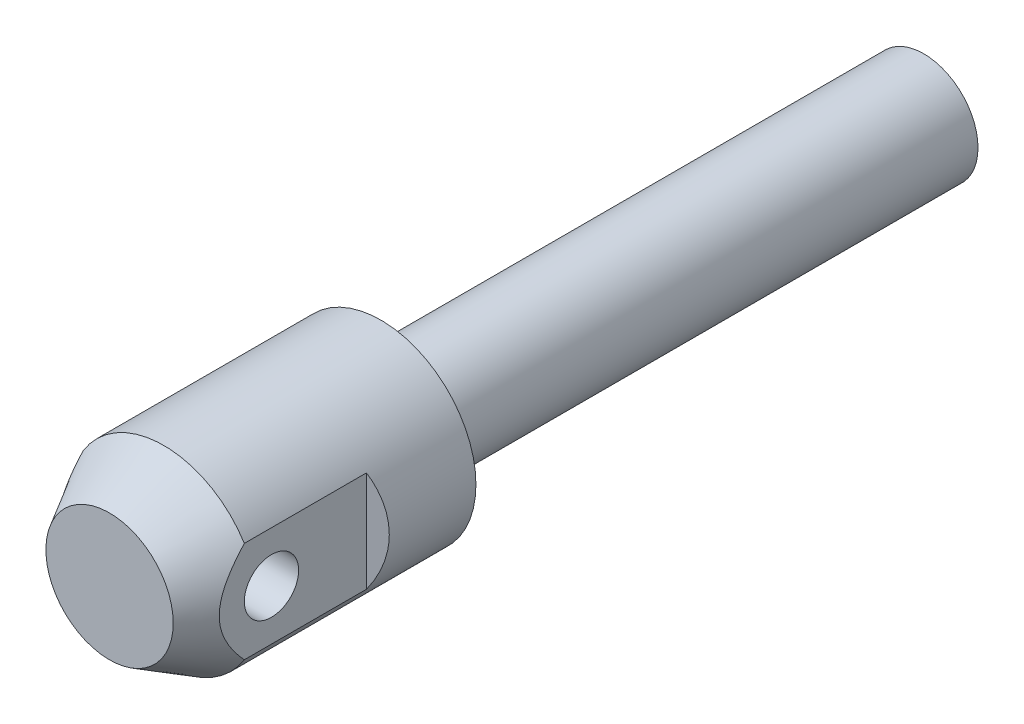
ISO-10303-21;
HEADER;
FILE_DESCRIPTION(('STEP AP214'),'2;1');
FILE_NAME('part.step','',(''),(''),'','','');
FILE_SCHEMA(('AUTOMOTIVE_DESIGN { 1 0 10303 214 1 1 1 1 }'));
ENDSEC;
DATA;
#1=APPLICATION_CONTEXT('core data for automotive mechanical design processes');
#2=APPLICATION_PROTOCOL_DEFINITION('international standard','automotive_design',2000,#1);
#3=PRODUCT_CONTEXT('',#1,'mechanical');
#4=PRODUCT('Part','Part','',(#3));
#5=PRODUCT_RELATED_PRODUCT_CATEGORY('part','',(#4));
#6=PRODUCT_DEFINITION_FORMATION('','',#4);
#7=PRODUCT_DEFINITION_CONTEXT('part definition',#1,'design');
#8=PRODUCT_DEFINITION('design','',#6,#7);
#9=PRODUCT_DEFINITION_SHAPE('','',#8);
#10=(LENGTH_UNIT() NAMED_UNIT(*) SI_UNIT(.MILLI.,.METRE.));
#11=(NAMED_UNIT(*) PLANE_ANGLE_UNIT() SI_UNIT($,.RADIAN.));
#12=(NAMED_UNIT(*) SI_UNIT($,.STERADIAN.) SOLID_ANGLE_UNIT());
#13=UNCERTAINTY_MEASURE_WITH_UNIT(LENGTH_MEASURE(1.E-05),#10,'distance_accuracy_value','');
#14=(GEOMETRIC_REPRESENTATION_CONTEXT(3) GLOBAL_UNCERTAINTY_ASSIGNED_CONTEXT((#13)) GLOBAL_UNIT_ASSIGNED_CONTEXT((#10,
#11,#12)) REPRESENTATION_CONTEXT('',''));
#15=CARTESIAN_POINT('',(0.,0.,0.));
#16=DIRECTION('',(0.,0.,1.));
#17=DIRECTION('',(1.,0.,0.));
#18=AXIS2_PLACEMENT_3D('',#15,#16,#17);
#19=CARTESIAN_POINT('',(0.,0.,20.));
#20=DIRECTION('',(0.,0.,1.));
#21=DIRECTION('',(1.,0.,0.));
#22=AXIS2_PLACEMENT_3D('',#19,#20,#21);
#23=CYLINDRICAL_SURFACE('',#22,10.5);
#24=CARTESIAN_POINT('',(0.,0.,0.));
#25=DIRECTION('',(0.,0.,1.));
#26=DIRECTION('',(1.,0.,0.));
#27=AXIS2_PLACEMENT_3D('',#24,#25,#26);
#28=CIRCLE('',#27,10.5);
#29=CARTESIAN_POINT('',(10.5,0.,0.));
#30=VERTEX_POINT('',#29);
#31=EDGE_CURVE('E82',#30,#30,#28,.T.);
#32=ORIENTED_EDGE('',*,*,#31,.T.);
#33=EDGE_LOOP('',(#32));
#34=FACE_BOUND('',#33,.T.);
#35=CARTESIAN_POINT('',(0.,0.,24.));
#36=DIRECTION('',(0.,0.,1.));
#37=DIRECTION('',(1.,0.,0.));
#38=AXIS2_PLACEMENT_3D('',#35,#36,#37);
#39=CIRCLE('',#38,10.5);
#40=CARTESIAN_POINT('',(-8.9,-5.57135531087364,24.));
#41=VERTEX_POINT('',#40);
#42=CARTESIAN_POINT('',(8.9,-5.57135531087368,24.));
#43=VERTEX_POINT('',#42);
#44=EDGE_CURVE('E67',#41,#43,#39,.T.);
#45=ORIENTED_EDGE('',*,*,#44,.F.);
#46=DIRECTION('',(0.,0.,1.));
#47=VECTOR('',#46,1.);
#48=CARTESIAN_POINT('',(-8.9,-5.57135531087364,20.));
#49=LINE('',#48,#47);
#50=CARTESIAN_POINT('',(-8.9,-5.57135531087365,10.5));
#51=VERTEX_POINT('',#50);
#52=EDGE_CURVE('E30',#41,#51,#49,.F.);
#53=ORIENTED_EDGE('',*,*,#52,.T.);
#54=CARTESIAN_POINT('',(0.,0.,15.6384173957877));
#55=DIRECTION('',(0.5,0.,-0.866025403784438));
#56=DIRECTION('',(0.866025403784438,0.,0.5));
#57=AXIS2_PLACEMENT_3D('',#54,#55,#56);
#58=ELLIPSE('',#57,12.1243556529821,10.5);
#59=CARTESIAN_POINT('',(-8.9,5.57135531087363,10.5));
#60=VERTEX_POINT('',#59);
#61=EDGE_CURVE('E9',#60,#51,#58,.F.);
#62=ORIENTED_EDGE('',*,*,#61,.F.);
#63=DIRECTION('',(0.,0.,1.));
#64=VECTOR('',#63,1.);
#65=CARTESIAN_POINT('',(-8.9,5.57135531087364,20.));
#66=LINE('',#65,#64);
#67=CARTESIAN_POINT('',(-8.9,5.57135531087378,24.));
#68=VERTEX_POINT('',#67);
#69=EDGE_CURVE('E63',#60,#68,#66,.T.);
#70=ORIENTED_EDGE('',*,*,#69,.T.);
#71=CARTESIAN_POINT('',(8.9,5.57135531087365,24.));
#72=VERTEX_POINT('',#71);
#73=EDGE_CURVE('E79',#72,#68,#39,.T.);
#74=ORIENTED_EDGE('',*,*,#73,.F.);
#75=DIRECTION('',(0.,0.,1.));
#76=VECTOR('',#75,1.);
#77=CARTESIAN_POINT('',(8.9,5.57135531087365,20.));
#78=LINE('',#77,#76);
#79=CARTESIAN_POINT('',(8.9,5.57135531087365,10.5));
#80=VERTEX_POINT('',#79);
#81=EDGE_CURVE('E38',#80,#72,#78,.T.);
#82=ORIENTED_EDGE('',*,*,#81,.F.);
#83=CARTESIAN_POINT('',(0.,0.,15.6384173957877));
#84=DIRECTION('',(0.5,0.,0.866025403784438));
#85=DIRECTION('',(-0.866025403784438,0.,0.5));
#86=AXIS2_PLACEMENT_3D('',#83,#84,#85);
#87=ELLIPSE('',#86,12.1243556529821,10.5);
#88=CARTESIAN_POINT('',(8.9,-5.57135531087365,10.5));
#89=VERTEX_POINT('',#88);
#90=EDGE_CURVE('E99',#80,#89,#87,.F.);
#91=ORIENTED_EDGE('',*,*,#90,.T.);
#92=DIRECTION('',(0.,0.,1.));
#93=VECTOR('',#92,1.);
#94=CARTESIAN_POINT('',(8.9,-5.57135531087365,20.));
#95=LINE('',#94,#93);
#96=EDGE_CURVE('E74',#43,#89,#95,.F.);
#97=ORIENTED_EDGE('',*,*,#96,.F.);
#98=EDGE_LOOP('',(#45,#53,#62,#70,#74,#82,#91,#97));
#99=FACE_BOUND('',#98,.T.);
#100=ADVANCED_FACE('F14',(#34,#99),#23,.T.);
#101=CARTESIAN_POINT('',(0.,0.,30.));
#102=DIRECTION('',(0.,0.,-1.));
#103=DIRECTION('',(-1.,0.,0.));
#104=AXIS2_PLACEMENT_3D('',#101,#102,#103);
#105=CONICAL_SURFACE('',#104,7.03589838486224,0.523598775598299);
#106=CARTESIAN_POINT('',(0.,0.,30.));
#107=DIRECTION('',(0.,0.,1.));
#108=DIRECTION('',(1.,0.,0.));
#109=AXIS2_PLACEMENT_3D('',#106,#107,#108);
#110=CIRCLE('',#109,7.03589838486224);
#111=CARTESIAN_POINT('',(7.03589838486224,0.,30.));
#112=VERTEX_POINT('',#111);
#113=EDGE_CURVE('E76',#112,#112,#110,.T.);
#114=ORIENTED_EDGE('',*,*,#113,.F.);
#115=EDGE_LOOP('',(#114));
#116=FACE_BOUND('',#115,.T.);
#117=ORIENTED_EDGE('',*,*,#73,.T.);
#118=CARTESIAN_POINT('',(-8.9,-14.6906497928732,12.4363137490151));
#119=CARTESIAN_POINT('',(-8.9,-14.3724086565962,12.9076685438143));
#120=CARTESIAN_POINT('',(-8.9,-14.0523322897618,13.3777974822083));
#121=CARTESIAN_POINT('',(-8.9,-13.407548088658,14.3149810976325));
#122=CARTESIAN_POINT('',(-8.9,-13.0828394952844,14.7820352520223));
#123=CARTESIAN_POINT('',(-8.9,-12.4255724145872,15.7156455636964));
#124=CARTESIAN_POINT('',(-8.9,-12.0929741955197,16.1821738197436));
#125=CARTESIAN_POINT('',(-8.9,-11.4209532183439,17.1102280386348));
#126=CARTESIAN_POINT('',(-8.9,-11.0815311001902,17.571754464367));
#127=CARTESIAN_POINT('',(-8.9,-10.3609340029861,18.5327258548));
#128=CARTESIAN_POINT('',(-8.9,-9.97889352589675,19.0315259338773));
#129=CARTESIAN_POINT('',(-8.9,-9.39571279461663,19.7718918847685));
#130=CARTESIAN_POINT('',(-8.9,-9.19959708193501,20.0174174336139));
#131=CARTESIAN_POINT('',(-8.9,-8.80347960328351,20.5053096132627));
#132=CARTESIAN_POINT('',(-8.9,-8.60347794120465,20.747676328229));
#133=CARTESIAN_POINT('',(-8.9,-8.19961550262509,21.2278453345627));
#134=CARTESIAN_POINT('',(-8.9,-7.99576927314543,21.4656598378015));
#135=CARTESIAN_POINT('',(-8.9,-7.58284404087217,21.9366910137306));
#136=CARTESIAN_POINT('',(-8.9,-7.37376534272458,22.1699079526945));
#137=CARTESIAN_POINT('',(-8.9,-6.94954847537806,22.6305427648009));
#138=CARTESIAN_POINT('',(-8.9,-6.7344136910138,22.8579637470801));
#139=CARTESIAN_POINT('',(-8.9,-6.29685389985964,23.3056566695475));
#140=CARTESIAN_POINT('',(-8.9,-6.0744301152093,23.5259297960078));
#141=CARTESIAN_POINT('',(-8.9,-5.72815075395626,23.8552673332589));
#142=CARTESIAN_POINT('',(-8.9,-5.60744255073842,23.967645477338));
#143=CARTESIAN_POINT('',(-8.9,-5.36335255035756,24.1894714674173));
#144=CARTESIAN_POINT('',(-8.9,-5.23997070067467,24.2989192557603));
#145=CARTESIAN_POINT('',(-8.9,-4.99019185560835,24.5144981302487));
#146=CARTESIAN_POINT('',(-8.9,-4.86379293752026,24.6206269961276));
#147=CARTESIAN_POINT('',(-8.9,-4.60777909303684,24.8289230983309));
#148=CARTESIAN_POINT('',(-8.9,-4.478164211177,24.9310903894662));
#149=CARTESIAN_POINT('',(-8.9,-4.08693511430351,25.2284953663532));
#150=CARTESIAN_POINT('',(-8.9,-3.82016647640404,25.41706407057));
#151=CARTESIAN_POINT('',(-8.9,-3.27068989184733,25.7692475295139));
#152=CARTESIAN_POINT('',(-8.9,-2.98800127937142,25.9328916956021));
#153=CARTESIAN_POINT('',(-8.9,-2.55061558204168,26.1525542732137));
#154=CARTESIAN_POINT('',(-8.9,-2.40241326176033,26.2215402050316));
#155=CARTESIAN_POINT('',(-8.9,-2.10165294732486,26.34932813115));
#156=CARTESIAN_POINT('',(-8.9,-1.94909533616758,26.4081310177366));
#157=CARTESIAN_POINT('',(-8.9,-1.64010234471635,26.5139102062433));
#158=CARTESIAN_POINT('',(-8.9,-1.48367177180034,26.5609004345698));
#159=CARTESIAN_POINT('',(-8.9,-1.16742727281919,26.6415877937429));
#160=CARTESIAN_POINT('',(-8.9,-1.00761423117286,26.6752883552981));
#161=CARTESIAN_POINT('',(-8.9,-0.683771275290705,26.7284010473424));
#162=CARTESIAN_POINT('',(-8.9,-0.519714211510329,26.747649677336));
#163=CARTESIAN_POINT('',(-8.9,-0.190509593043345,26.7703811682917));
#164=CARTESIAN_POINT('',(-8.9,-0.0253621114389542,26.7738650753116));
#165=CARTESIAN_POINT('',(-8.9,0.304423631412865,26.7649088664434));
#166=CARTESIAN_POINT('',(-8.9,0.46906208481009,26.7524757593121));
#167=CARTESIAN_POINT('',(-8.9,0.796447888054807,26.7122663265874));
#168=CARTESIAN_POINT('',(-8.9,0.959194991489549,26.684488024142));
#169=CARTESIAN_POINT('',(-8.9,1.30407432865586,26.6098776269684));
#170=CARTESIAN_POINT('',(-8.9,1.48574670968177,26.5609294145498));
#171=CARTESIAN_POINT('',(-8.9,1.84395793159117,26.4468573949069));
#172=CARTESIAN_POINT('',(-8.9,2.02049430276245,26.3817259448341));
#173=CARTESIAN_POINT('',(-8.9,2.36948052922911,26.2370400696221));
#174=CARTESIAN_POINT('',(-8.9,2.54187510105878,26.1573535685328));
#175=CARTESIAN_POINT('',(-8.9,2.88068743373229,25.9863393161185));
#176=CARTESIAN_POINT('',(-8.9,3.0471064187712,25.8950139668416));
#177=CARTESIAN_POINT('',(-8.9,3.41294088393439,25.6799946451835));
#178=CARTESIAN_POINT('',(-8.9,3.61085279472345,25.5537533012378));
#179=CARTESIAN_POINT('',(-8.9,3.99879031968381,25.2896252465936));
#180=CARTESIAN_POINT('',(-8.9,4.18881244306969,25.1517334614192));
#181=CARTESIAN_POINT('',(-8.9,4.56236330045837,24.8662868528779));
#182=CARTESIAN_POINT('',(-8.9,4.7458696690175,24.7187029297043));
#183=CARTESIAN_POINT('',(-8.9,5.10659178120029,24.4161320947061));
#184=CARTESIAN_POINT('',(-8.9,5.28380851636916,24.2611463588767));
#185=CARTESIAN_POINT('',(-8.9,5.62449488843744,23.9526465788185));
#186=CARTESIAN_POINT('',(-8.9,5.78821792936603,23.7994111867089));
#187=CARTESIAN_POINT('',(-8.9,6.11130761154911,23.4884009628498));
#188=CARTESIAN_POINT('',(-8.9,6.27067390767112,23.3306257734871));
#189=CARTESIAN_POINT('',(-8.9,6.58433981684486,23.0125301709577));
#190=CARTESIAN_POINT('',(-8.9,6.73866911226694,22.8522389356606));
#191=CARTESIAN_POINT('',(-8.9,7.04392315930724,22.5285268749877));
#192=CARTESIAN_POINT('',(-8.9,7.19484883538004,22.3651069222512));
#193=CARTESIAN_POINT('',(-8.9,7.34430663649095,22.200375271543));
#194=B_SPLINE_CURVE_WITH_KNOTS('',3,(#118,#119,#120,#121,#122,#123,#124,#125,#126,#127,#128,
#129,#130,#131,#132,#133,#134,#135,#136,#137,#138,#139,#140,#141,#142,#143,#144,#145,#146,#147,
#148,#149,#150,#151,#152,#153,#154,#155,#156,#157,#158,#159,#160,#161,#162,#163,#164,#165,#166,
#167,#168,#169,#170,#171,#172,#173,#174,#175,#176,#177,#178,#179,#180,#181,#182,#183,#184,#185,
#186,#187,#188,#189,#190,#191,#192,#193),.UNSPECIFIED.,.F.,.F.,(4,2,2,2,2,2,2,2,2,2,2,2,2,2,2,2,
2,2,2,2,2,2,2,2,2,2,2,2,2,2,2,2,2,2,2,2,2,4),(0.,1.70619901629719,3.41268092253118,
5.13147394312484,6.85010651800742,8.73479437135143,9.67747072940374,10.6201219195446,
11.5597291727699,12.4992818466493,13.4383194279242,14.3772003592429,14.8719277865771,
15.3666649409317,15.8617262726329,16.3567807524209,17.335861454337,18.3137777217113,
18.8038864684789,19.2939522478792,19.7834375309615,20.2727963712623,20.7676113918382,
21.2623935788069,21.7569579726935,22.2515860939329,22.8151573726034,23.3789953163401,
23.94822975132,24.5173468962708,25.2210484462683,25.9250580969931,26.6312877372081,
27.3374055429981,28.0100429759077,28.6827335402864,29.3502139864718,30.0175109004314),.UNSPECIFIED.);
#195=EDGE_CURVE('E23',#68,#41,#194,.F.);
#196=ORIENTED_EDGE('',*,*,#195,.T.);
#197=ORIENTED_EDGE('',*,*,#44,.T.);
#198=CARTESIAN_POINT('',(8.9,-14.6906497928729,12.4363137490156));
#199=CARTESIAN_POINT('',(8.9,-14.3724086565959,12.9076685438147));
#200=CARTESIAN_POINT('',(8.9,-14.0523322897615,13.3777974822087));
#201=CARTESIAN_POINT('',(8.9,-13.4075480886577,14.3149810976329));
#202=CARTESIAN_POINT('',(8.9,-13.0828394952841,14.7820352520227));
#203=CARTESIAN_POINT('',(8.9,-12.4255724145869,15.7156455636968));
#204=CARTESIAN_POINT('',(8.9,-12.0929741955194,16.182173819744));
#205=CARTESIAN_POINT('',(8.9,-11.4209532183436,17.1102280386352));
#206=CARTESIAN_POINT('',(8.9,-11.0815311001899,17.5717544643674));
#207=CARTESIAN_POINT('',(8.9,-10.3609340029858,18.5327258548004));
#208=CARTESIAN_POINT('',(8.9,-9.97889352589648,19.0315259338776));
#209=CARTESIAN_POINT('',(8.9,-9.39571279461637,19.7718918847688));
#210=CARTESIAN_POINT('',(8.9,-9.19959708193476,20.0174174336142));
#211=CARTESIAN_POINT('',(8.9,-8.80347960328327,20.505309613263));
#212=CARTESIAN_POINT('',(8.9,-8.60347794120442,20.7476763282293));
#213=CARTESIAN_POINT('',(8.9,-8.19961550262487,21.227845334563));
#214=CARTESIAN_POINT('',(8.9,-7.99576927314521,21.4656598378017));
#215=CARTESIAN_POINT('',(8.9,-7.58284404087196,21.9366910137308));
#216=CARTESIAN_POINT('',(8.9,-7.37376534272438,22.1699079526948));
#217=CARTESIAN_POINT('',(8.9,-6.94954847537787,22.6305427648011));
#218=CARTESIAN_POINT('',(8.9,-6.73441369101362,22.8579637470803));
#219=CARTESIAN_POINT('',(8.9,-6.29685389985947,23.3056566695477));
#220=CARTESIAN_POINT('',(8.9,-6.07443011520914,23.525929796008));
#221=CARTESIAN_POINT('',(8.9,-5.72815075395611,23.855267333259));
#222=CARTESIAN_POINT('',(8.9,-5.60744255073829,23.9676454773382));
#223=CARTESIAN_POINT('',(8.9,-5.36335255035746,24.1894714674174));
#224=CARTESIAN_POINT('',(8.9,-5.23997070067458,24.2989192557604));
#225=CARTESIAN_POINT('',(8.9,-4.99019185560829,24.5144981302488));
#226=CARTESIAN_POINT('',(8.9,-4.86379293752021,24.6206269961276));
#227=CARTESIAN_POINT('',(8.9,-4.60777909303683,24.8289230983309));
#228=CARTESIAN_POINT('',(8.9,-4.478164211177,24.9310903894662));
#229=CARTESIAN_POINT('',(8.9,-4.08693511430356,25.2284953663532));
#230=CARTESIAN_POINT('',(8.9,-3.82016647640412,25.4170640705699));
#231=CARTESIAN_POINT('',(8.9,-3.27068989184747,25.7692475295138));
#232=CARTESIAN_POINT('',(8.9,-2.98800127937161,25.932891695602));
#233=CARTESIAN_POINT('',(8.9,-2.55061558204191,26.1525542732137));
#234=CARTESIAN_POINT('',(8.9,-2.40241326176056,26.2215402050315));
#235=CARTESIAN_POINT('',(8.9,-2.10165294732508,26.34932813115));
#236=CARTESIAN_POINT('',(8.9,-1.9490953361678,26.4081310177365));
#237=CARTESIAN_POINT('',(8.9,-1.64010234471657,26.5139102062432));
#238=CARTESIAN_POINT('',(8.9,-1.48367177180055,26.5609004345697));
#239=CARTESIAN_POINT('',(8.9,-1.16742727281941,26.6415877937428));
#240=CARTESIAN_POINT('',(8.9,-1.00761423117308,26.6752883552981));
#241=CARTESIAN_POINT('',(8.9,-0.683771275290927,26.7284010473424));
#242=CARTESIAN_POINT('',(8.9,-0.519714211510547,26.747649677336));
#243=CARTESIAN_POINT('',(8.9,-0.190509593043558,26.7703811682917));
#244=CARTESIAN_POINT('',(8.9,-0.0253621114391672,26.7738650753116));
#245=CARTESIAN_POINT('',(8.9,0.304423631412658,26.7649088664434));
#246=CARTESIAN_POINT('',(8.9,0.469062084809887,26.7524757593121));
#247=CARTESIAN_POINT('',(8.9,0.796447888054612,26.7122663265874));
#248=CARTESIAN_POINT('',(8.9,0.959194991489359,26.6844880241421));
#249=CARTESIAN_POINT('',(8.9,1.30407432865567,26.6098776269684));
#250=CARTESIAN_POINT('',(8.9,1.48574670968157,26.5609294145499));
#251=CARTESIAN_POINT('',(8.9,1.84395793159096,26.446857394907));
#252=CARTESIAN_POINT('',(8.9,2.02049430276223,26.3817259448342));
#253=CARTESIAN_POINT('',(8.9,2.36948052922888,26.2370400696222));
#254=CARTESIAN_POINT('',(8.9,2.54187510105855,26.1573535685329));
#255=CARTESIAN_POINT('',(8.9,2.88068743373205,25.9863393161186));
#256=CARTESIAN_POINT('',(8.9,3.04710641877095,25.8950139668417));
#257=CARTESIAN_POINT('',(8.9,3.41294088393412,25.6799946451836));
#258=CARTESIAN_POINT('',(8.9,3.61085279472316,25.553753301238));
#259=CARTESIAN_POINT('',(8.9,3.99879031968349,25.2896252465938));
#260=CARTESIAN_POINT('',(8.9,4.18881244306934,25.1517334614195));
#261=CARTESIAN_POINT('',(8.9,4.56236330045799,24.8662868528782));
#262=CARTESIAN_POINT('',(8.9,4.7458696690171,24.7187029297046));
#263=CARTESIAN_POINT('',(8.9,5.10659178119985,24.4161320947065));
#264=CARTESIAN_POINT('',(8.9,5.28380851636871,24.2611463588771));
#265=CARTESIAN_POINT('',(8.9,5.62449488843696,23.952646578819));
#266=CARTESIAN_POINT('',(8.9,5.78821792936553,23.7994111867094));
#267=CARTESIAN_POINT('',(8.9,6.11130761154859,23.4884009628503));
#268=CARTESIAN_POINT('',(8.9,6.27067390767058,23.3306257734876));
#269=CARTESIAN_POINT('',(8.9,6.5843398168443,23.0125301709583));
#270=CARTESIAN_POINT('',(8.9,6.73866911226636,22.8522389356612));
#271=CARTESIAN_POINT('',(8.9,7.04392315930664,22.5285268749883));
#272=CARTESIAN_POINT('',(8.9,7.19484883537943,22.3651069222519));
#273=CARTESIAN_POINT('',(8.9,7.34430663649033,22.2003752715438));
#274=B_SPLINE_CURVE_WITH_KNOTS('',3,(#198,#199,#200,#201,#202,#203,#204,#205,#206,#207,#208,
#209,#210,#211,#212,#213,#214,#215,#216,#217,#218,#219,#220,#221,#222,#223,#224,#225,#226,#227,
#228,#229,#230,#231,#232,#233,#234,#235,#236,#237,#238,#239,#240,#241,#242,#243,#244,#245,#246,
#247,#248,#249,#250,#251,#252,#253,#254,#255,#256,#257,#258,#259,#260,#261,#262,#263,#264,#265,
#266,#267,#268,#269,#270,#271,#272,#273),.UNSPECIFIED.,.F.,.F.,(4,2,2,2,2,2,2,2,2,2,2,2,2,2,2,2,
2,2,2,2,2,2,2,2,2,2,2,2,2,2,2,2,2,2,2,2,2,4),(0.,1.70619901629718,3.41268092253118,
5.13147394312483,6.85010651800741,8.73479437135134,9.67747072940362,10.6201219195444,
11.5597291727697,12.4992818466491,13.4383194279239,14.3772003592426,14.8719277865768,
15.3666649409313,15.8617262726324,16.3567807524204,17.3358614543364,18.3137777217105,
18.8038864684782,19.2939522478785,19.7834375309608,20.2727963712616,20.7676113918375,
21.2623935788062,21.7569579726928,22.2515860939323,22.8151573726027,23.3789953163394,
23.9482297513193,24.51734689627,25.2210484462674,25.9250580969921,26.6312877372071,
27.337405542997,28.0100429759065,28.6827335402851,29.3502139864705,30.01751090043),.UNSPECIFIED.);
#275=EDGE_CURVE('E91',#72,#43,#274,.F.);
#276=ORIENTED_EDGE('',*,*,#275,.F.);
#277=EDGE_LOOP('',(#117,#196,#197,#276));
#278=FACE_BOUND('',#277,.T.);
#279=ADVANCED_FACE('F104',(#116,#278),#105,.T.);
#280=CARTESIAN_POINT('',(0.,7.03589838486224,30.));
#281=DIRECTION('',(0.,0.,-1.));
#282=DIRECTION('',(-1.,0.,0.));
#283=AXIS2_PLACEMENT_3D('',#280,#281,#282);
#284=PLANE('',#283);
#285=ORIENTED_EDGE('',*,*,#113,.T.);
#286=EDGE_LOOP('',(#285));
#287=FACE_BOUND('',#286,.T.);
#288=ADVANCED_FACE('F16',(#287),#284,.F.);
#289=CARTESIAN_POINT('',(0.,6.,-60.));
#290=DIRECTION('',(0.,0.,-1.));
#291=DIRECTION('',(-1.,0.,0.));
#292=AXIS2_PLACEMENT_3D('',#289,#290,#291);
#293=PLANE('',#292);
#294=CARTESIAN_POINT('',(0.,0.,-60.));
#295=DIRECTION('',(0.,0.,1.));
#296=DIRECTION('',(1.,0.,0.));
#297=AXIS2_PLACEMENT_3D('',#294,#295,#296);
#298=CIRCLE('',#297,6.);
#299=CARTESIAN_POINT('',(6.,0.,-60.));
#300=VERTEX_POINT('',#299);
#301=EDGE_CURVE('E88',#300,#300,#298,.T.);
#302=ORIENTED_EDGE('',*,*,#301,.F.);
#303=EDGE_LOOP('',(#302));
#304=FACE_BOUND('',#303,.T.);
#305=ADVANCED_FACE('F147',(#304),#293,.T.);
#306=CARTESIAN_POINT('',(0.,0.,20.));
#307=DIRECTION('',(0.,0.,1.));
#308=DIRECTION('',(1.,0.,0.));
#309=AXIS2_PLACEMENT_3D('',#306,#307,#308);
#310=CYLINDRICAL_SURFACE('',#309,6.);
#311=ORIENTED_EDGE('',*,*,#301,.T.);
#312=EDGE_LOOP('',(#311));
#313=FACE_BOUND('',#312,.T.);
#314=CARTESIAN_POINT('',(0.,0.,0.));
#315=DIRECTION('',(0.,0.,1.));
#316=DIRECTION('',(1.,0.,0.));
#317=AXIS2_PLACEMENT_3D('',#314,#315,#316);
#318=CIRCLE('',#317,6.);
#319=CARTESIAN_POINT('',(6.,0.,0.));
#320=VERTEX_POINT('',#319);
#321=EDGE_CURVE('E85',#320,#320,#318,.T.);
#322=ORIENTED_EDGE('',*,*,#321,.F.);
#323=EDGE_LOOP('',(#322));
#324=FACE_BOUND('',#323,.T.);
#325=ADVANCED_FACE('F134',(#313,#324),#310,.T.);
#326=CARTESIAN_POINT('',(0.,6.,0.));
#327=DIRECTION('',(0.,0.,1.));
#328=DIRECTION('',(1.,0.,0.));
#329=AXIS2_PLACEMENT_3D('',#326,#327,#328);
#330=PLANE('',#329);
#331=ORIENTED_EDGE('',*,*,#31,.F.);
#332=EDGE_LOOP('',(#331));
#333=FACE_BOUND('',#332,.T.);
#334=ORIENTED_EDGE('',*,*,#321,.T.);
#335=EDGE_LOOP('',(#334));
#336=FACE_BOUND('',#335,.T.);
#337=ADVANCED_FACE('F125',(#333,#336),#330,.F.);
#338=CARTESIAN_POINT('',(8.9,-15.,10.5));
#339=DIRECTION('',(0.5,0.,0.866025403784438));
#340=DIRECTION('',(0.866025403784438,0.,-0.5));
#341=AXIS2_PLACEMENT_3D('',#338,#339,#340);
#342=PLANE('',#341);
#343=DIRECTION('',(0.,1.,0.));
#344=VECTOR('',#343,1.);
#345=CARTESIAN_POINT('',(8.9,-15.,10.5));
#346=LINE('',#345,#344);
#347=EDGE_CURVE('E68',#89,#80,#346,.T.);
#348=ORIENTED_EDGE('',*,*,#347,.F.);
#349=ORIENTED_EDGE('',*,*,#90,.F.);
#350=EDGE_LOOP('',(#348,#349));
#351=FACE_BOUND('',#350,.T.);
#352=ADVANCED_FACE('F123',(#351),#342,.T.);
#353=CARTESIAN_POINT('',(8.9,-15.,10.5));
#354=DIRECTION('',(-1.,0.,0.));
#355=DIRECTION('',(0.,0.,1.));
#356=AXIS2_PLACEMENT_3D('',#353,#354,#355);
#357=PLANE('',#356);
#358=CARTESIAN_POINT('',(8.9,0.,21.));
#359=DIRECTION('',(1.,0.,0.));
#360=DIRECTION('',(0.,0.,-1.));
#361=AXIS2_PLACEMENT_3D('',#358,#359,#360);
#362=CIRCLE('',#361,3.);
#363=CARTESIAN_POINT('',(8.9,0.,18.));
#364=VERTEX_POINT('',#363);
#365=EDGE_CURVE('E233',#364,#364,#362,.T.);
#366=ORIENTED_EDGE('',*,*,#365,.F.);
#367=EDGE_LOOP('',(#366));
#368=FACE_BOUND('',#367,.T.);
#369=ORIENTED_EDGE('',*,*,#96,.T.);
#370=ORIENTED_EDGE('',*,*,#347,.T.);
#371=ORIENTED_EDGE('',*,*,#81,.T.);
#372=ORIENTED_EDGE('',*,*,#275,.T.);
#373=EDGE_LOOP('',(#369,#370,#371,#372));
#374=FACE_BOUND('',#373,.T.);
#375=ADVANCED_FACE('F101',(#368,#374),#357,.F.);
#376=CARTESIAN_POINT('',(-8.9,-15.,10.5));
#377=DIRECTION('',(-1.,0.,0.));
#378=DIRECTION('',(0.,0.,1.));
#379=AXIS2_PLACEMENT_3D('',#376,#377,#378);
#380=PLANE('',#379);
#381=CARTESIAN_POINT('',(-8.9,0.,21.));
#382=DIRECTION('',(-1.,0.,0.));
#383=DIRECTION('',(0.,0.,1.));
#384=AXIS2_PLACEMENT_3D('',#381,#382,#383);
#385=CIRCLE('',#384,3.);
#386=CARTESIAN_POINT('',(-8.9,0.,24.));
#387=VERTEX_POINT('',#386);
#388=EDGE_CURVE('E18',#387,#387,#385,.T.);
#389=ORIENTED_EDGE('',*,*,#388,.F.);
#390=EDGE_LOOP('',(#389));
#391=FACE_BOUND('',#390,.T.);
#392=ORIENTED_EDGE('',*,*,#195,.F.);
#393=ORIENTED_EDGE('',*,*,#69,.F.);
#394=DIRECTION('',(0.,1.,0.));
#395=VECTOR('',#394,1.);
#396=CARTESIAN_POINT('',(-8.9,-15.,10.5));
#397=LINE('',#396,#395);
#398=EDGE_CURVE('E59',#51,#60,#397,.T.);
#399=ORIENTED_EDGE('',*,*,#398,.F.);
#400=ORIENTED_EDGE('',*,*,#52,.F.);
#401=EDGE_LOOP('',(#392,#393,#399,#400));
#402=FACE_BOUND('',#401,.T.);
#403=ADVANCED_FACE('F62',(#391,#402),#380,.T.);
#404=CARTESIAN_POINT('',(-8.9,-15.,10.5));
#405=DIRECTION('',(0.5,0.,-0.866025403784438));
#406=DIRECTION('',(-0.866025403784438,0.,-0.5));
#407=AXIS2_PLACEMENT_3D('',#404,#405,#406);
#408=PLANE('',#407);
#409=ORIENTED_EDGE('',*,*,#61,.T.);
#410=ORIENTED_EDGE('',*,*,#398,.T.);
#411=EDGE_LOOP('',(#409,#410));
#412=FACE_BOUND('',#411,.T.);
#413=ADVANCED_FACE('F58',(#412),#408,.F.);
#414=CARTESIAN_POINT('',(-10.5,0.,21.));
#415=DIRECTION('',(1.,0.,0.));
#416=DIRECTION('',(0.,0.,-1.));
#417=AXIS2_PLACEMENT_3D('',#414,#415,#416);
#418=CYLINDRICAL_SURFACE('',#417,3.);
#419=ORIENTED_EDGE('',*,*,#388,.T.);
#420=EDGE_LOOP('',(#419));
#421=FACE_BOUND('',#420,.T.);
#422=ORIENTED_EDGE('',*,*,#365,.T.);
#423=EDGE_LOOP('',(#422));
#424=FACE_BOUND('',#423,.T.);
#425=ADVANCED_FACE('F121',(#421,#424),#418,.F.);
#426=CLOSED_SHELL('',(#100,#279,#288,#305,#325,#337,#352,#375,#403,#413,#425));
#427=MANIFOLD_SOLID_BREP('B1',#426);
#428=ADVANCED_BREP_SHAPE_REPRESENTATION('',(#18,#427),#14);
#429=SHAPE_DEFINITION_REPRESENTATION(#9,#428);
ENDSEC;
END-ISO-10303-21;
